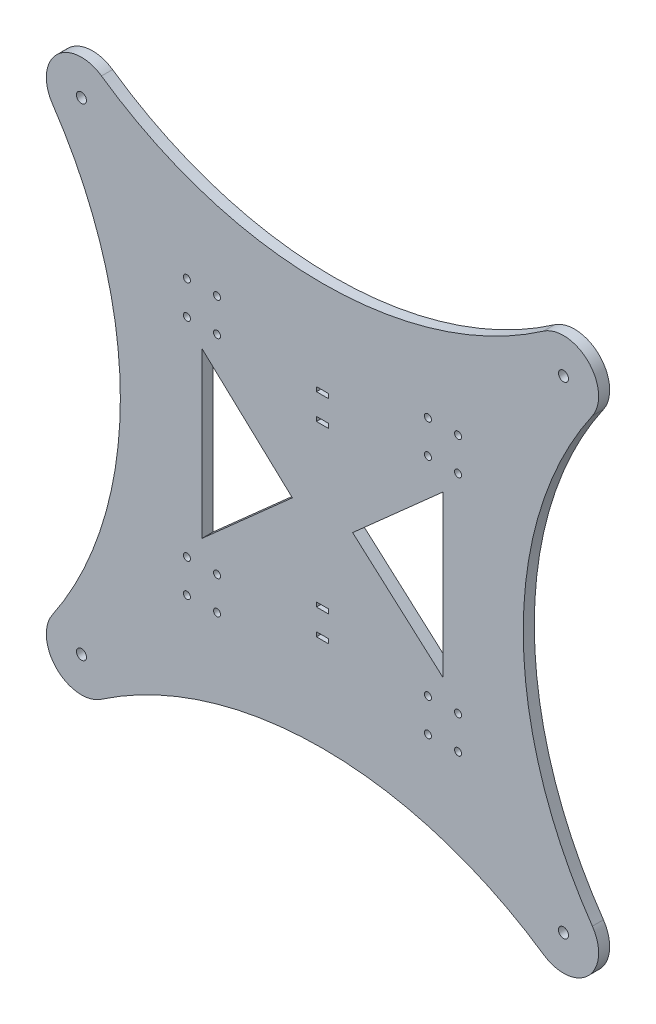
from build123d import *

# Parameters (mm, degrees)
SKETCH1_R           = 1.75
SKETCH1_R_2         = 2.5
SKETCH1_W           = 6
SKETCH1_H           = 2.2
BOSS_EXTRUDE1_DEPTH = 5.5


with BuildPart() as part:
    # Sketch1 → Boss-Extrude1 (new body)
    with BuildSketch(Plane.XY):
        with BuildLine():
            ThreePointArc((-254.481950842, 9.824617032), (-252.361973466, -12.386751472), (-230.146404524, -14.462249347))
            ThreePointArc((-230.146404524, -14.462249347), (-120, 19.494625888), (-9.853595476, -14.462249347))
            ThreePointArc((-9.853595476, -14.462249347), (12.425169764, -12.32335816), (14.380688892, 9.972250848))
            ThreePointArc((14.380688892, 9.972250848), (-20.035892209, 120), (14.380688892, 230.027749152))
            ThreePointArc((14.380688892, 230.027749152), (12.37287259, 252.375864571), (-9.975727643, 254.378277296))
            ThreePointArc((-9.975727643, 254.378277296), (-120, 219.948180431), (-230.024272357, 254.378277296))
            ThreePointArc((-230.024272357, 254.378277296), (-252.309408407, 252.438989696), (-254.481950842, 230.175382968))
            ThreePointArc((-254.481950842, 230.175382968), (-220.636894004, 120), (-254.481950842, 9.824617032))
        make_face()
        with Locations((-187.499997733, 188.249997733)):
            Circle(SKETCH1_R, mode=Mode.SUBTRACT)
        with Locations((-172.499997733, 188.249997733)):
            Circle(SKETCH1_R, mode=Mode.SUBTRACT)
        with Locations((-187.499997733, 171.749997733)):
            Circle(SKETCH1_R, mode=Mode.SUBTRACT)
        with Locations((-172.499997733, 171.749997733)):
            Circle(SKETCH1_R, mode=Mode.SUBTRACT)
        with Locations((-67.500002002, 188.249997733)):
            Circle(SKETCH1_R, mode=Mode.SUBTRACT)
        with Locations((-52.5, 188.249997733)):
            Circle(SKETCH1_R, mode=Mode.SUBTRACT)
        with Locations((-67.500002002, 171.749997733)):
            Circle(SKETCH1_R, mode=Mode.SUBTRACT)
        with Locations((-52.5, 171.749997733)):
            Circle(SKETCH1_R, mode=Mode.SUBTRACT)
        with Locations((-187.499997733, 68.250002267)):
            Circle(SKETCH1_R, mode=Mode.SUBTRACT)
        with Locations((-172.499997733, 68.250002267)):
            Circle(SKETCH1_R, mode=Mode.SUBTRACT)
        with Locations((-187.499997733, 51.750002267)):
            Circle(SKETCH1_R, mode=Mode.SUBTRACT)
        with Locations((-172.499997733, 51.750002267)):
            Circle(SKETCH1_R, mode=Mode.SUBTRACT)
        with Locations((-67.5, 68.250002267)):
            Circle(SKETCH1_R, mode=Mode.SUBTRACT)
        with Locations((-52.5, 68.250002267)):
            Circle(SKETCH1_R, mode=Mode.SUBTRACT)
        with Locations((-67.5, 51.750002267)):
            Circle(SKETCH1_R, mode=Mode.SUBTRACT)
        with Locations((-52.5, 51.750002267)):
            Circle(SKETCH1_R, mode=Mode.SUBTRACT)
        with Locations((-240, 240)):
            Circle(SKETCH1_R_2, mode=Mode.SUBTRACT)
        with Locations((0, 240)):
            Circle(SKETCH1_R_2, mode=Mode.SUBTRACT)
        with Locations((-240, 0)):
            Circle(SKETCH1_R_2, mode=Mode.SUBTRACT)
        Circle(SKETCH1_R_2, mode=Mode.SUBTRACT)
        with Locations((-120, 80)):
            Rectangle(SKETCH1_W, SKETCH1_H, mode=Mode.SUBTRACT)
        Polygon((-123, 160), (-123, 158.9), (-117, 158.9), (-117, 161.1), (-123, 161.1), align=None, mode=Mode.SUBTRACT)
        Polygon((-179.999997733, 80), (-135, 120), (-179.999997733, 161.845451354), align=None, mode=Mode.SUBTRACT)
        Polygon((-105, 120), (-60.000001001, 80.000001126), (-60.000001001, 160.000001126), align=None, mode=Mode.SUBTRACT)
        with Locations((-120, 172.849997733)):
            Rectangle(SKETCH1_W, SKETCH1_H, mode=Mode.SUBTRACT)
        with Locations((-120, 67.150002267)):
            Rectangle(SKETCH1_W, SKETCH1_H, mode=Mode.SUBTRACT)
    extrude(amount=BOSS_EXTRUDE1_DEPTH)


solid = part.part
